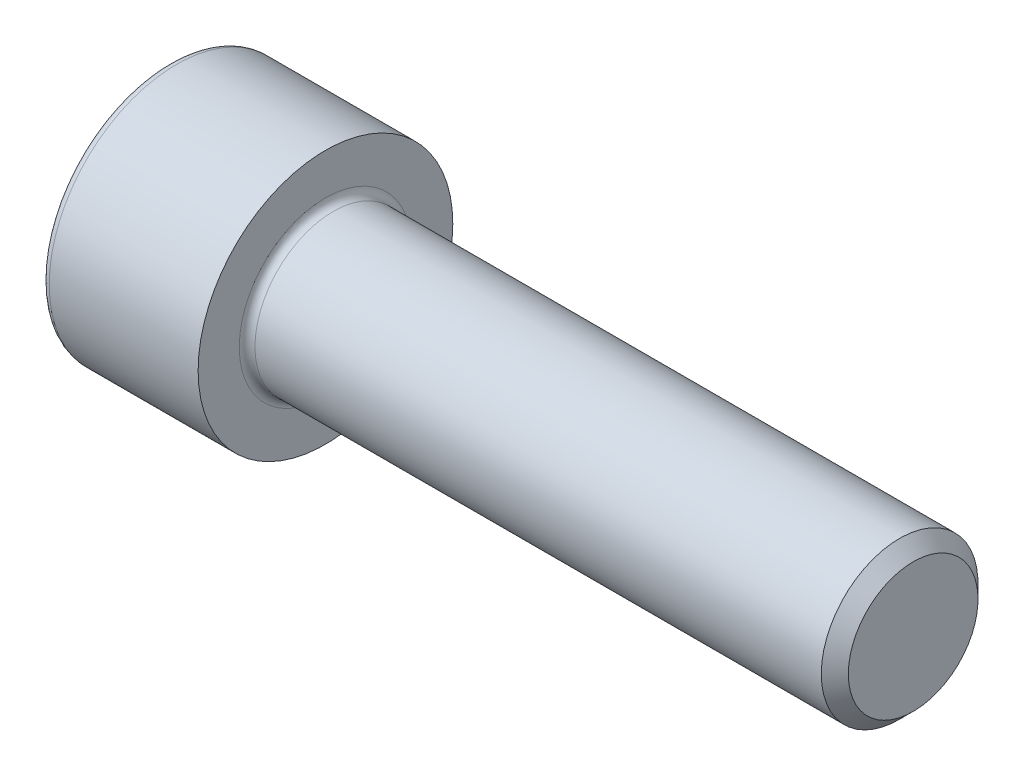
ISO-10303-21;
HEADER;
FILE_DESCRIPTION(('STEP AP214'),'2;1');
FILE_NAME('part.step','',(''),(''),'','','');
FILE_SCHEMA(('AUTOMOTIVE_DESIGN { 1 0 10303 214 1 1 1 1 }'));
ENDSEC;
DATA;
#1=APPLICATION_CONTEXT('core data for automotive mechanical design processes');
#2=APPLICATION_PROTOCOL_DEFINITION('international standard','automotive_design',2000,#1);
#3=PRODUCT_CONTEXT('',#1,'mechanical');
#4=PRODUCT('Part','Part','',(#3));
#5=PRODUCT_RELATED_PRODUCT_CATEGORY('part','',(#4));
#6=PRODUCT_DEFINITION_FORMATION('','',#4);
#7=PRODUCT_DEFINITION_CONTEXT('part definition',#1,'design');
#8=PRODUCT_DEFINITION('design','',#6,#7);
#9=PRODUCT_DEFINITION_SHAPE('','',#8);
#10=(LENGTH_UNIT() NAMED_UNIT(*) SI_UNIT(.MILLI.,.METRE.));
#11=(NAMED_UNIT(*) PLANE_ANGLE_UNIT() SI_UNIT($,.RADIAN.));
#12=(NAMED_UNIT(*) SI_UNIT($,.STERADIAN.) SOLID_ANGLE_UNIT());
#13=UNCERTAINTY_MEASURE_WITH_UNIT(LENGTH_MEASURE(1.E-05),#10,'distance_accuracy_value','');
#14=(GEOMETRIC_REPRESENTATION_CONTEXT(3) GLOBAL_UNCERTAINTY_ASSIGNED_CONTEXT((#13)) GLOBAL_UNIT_ASSIGNED_CONTEXT((#10,
#11,#12)) REPRESENTATION_CONTEXT('',''));
#15=CARTESIAN_POINT('',(0.,0.,0.));
#16=DIRECTION('',(0.,0.,1.));
#17=DIRECTION('',(1.,0.,0.));
#18=AXIS2_PLACEMENT_3D('',#15,#16,#17);
#19=CARTESIAN_POINT('',(4.00000000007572,-1.11022302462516E-13,1.66533453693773E-13));
#20=DIRECTION('',(-0.999999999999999,0.,0.));
#21=DIRECTION('',(0.,0.,0.999999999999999));
#22=AXIS2_PLACEMENT_3D('',#19,#20,#21);
#23=CONICAL_SURFACE('',#22,3.04749999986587,1.04719755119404);
#24=CARTESIAN_POINT('',(5.75947494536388,-1.11022302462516E-13,2.77555756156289E-13));
#25=VERTEX_POINT('',#24);
#26=VERTEX_LOOP('',#25);
#27=FACE_BOUND('',#26,.T.);
#28=CARTESIAN_POINT('',(4.00000000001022,-1.11022302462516E-13,2.22044604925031E-13));
#29=DIRECTION('',(-0.999999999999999,0.,0.));
#30=DIRECTION('',(0.,0.,0.999999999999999));
#31=AXIS2_PLACEMENT_3D('',#28,#29,#30);
#32=CIRCLE('',#31,3.04749999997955);
#33=CARTESIAN_POINT('',(4.00000000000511,-2.63921241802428,1.52374999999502));
#34=VERTEX_POINT('',#33);
#35=CARTESIAN_POINT('',(4.00000000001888,0.,3.04749999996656));
#36=VERTEX_POINT('',#35);
#37=EDGE_CURVE('E101',#34,#36,#32,.T.);
#38=ORIENTED_EDGE('',*,*,#37,.T.);
#39=CARTESIAN_POINT('',(4.00000000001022,-1.11022302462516E-13,2.22044604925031E-13));
#40=DIRECTION('',(-0.999999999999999,0.,0.));
#41=DIRECTION('',(0.,0.,0.999999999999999));
#42=AXIS2_PLACEMENT_3D('',#39,#40,#41);
#43=CIRCLE('',#42,3.04749999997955);
#44=CARTESIAN_POINT('',(4.00000000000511,2.63921241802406,1.52374999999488));
#45=VERTEX_POINT('',#44);
#46=EDGE_CURVE('E104',#36,#45,#43,.T.);
#47=ORIENTED_EDGE('',*,*,#46,.T.);
#48=CARTESIAN_POINT('',(4.00000000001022,-1.11022302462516E-13,2.22044604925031E-13));
#49=DIRECTION('',(-0.999999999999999,0.,0.));
#50=DIRECTION('',(0.,0.,0.999999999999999));
#51=AXIS2_PLACEMENT_3D('',#48,#49,#50);
#52=CIRCLE('',#51,3.04749999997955);
#53=CARTESIAN_POINT('',(4.000000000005,2.63921241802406,-1.52374999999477));
#54=VERTEX_POINT('',#53);
#55=EDGE_CURVE('E106',#45,#54,#52,.T.);
#56=ORIENTED_EDGE('',*,*,#55,.T.);
#57=CARTESIAN_POINT('',(4.00000000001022,-1.11022302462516E-13,2.22044604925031E-13));
#58=DIRECTION('',(-0.999999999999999,0.,0.));
#59=DIRECTION('',(0.,0.,0.999999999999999));
#60=AXIS2_PLACEMENT_3D('',#57,#58,#59);
#61=CIRCLE('',#60,3.04749999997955);
#62=CARTESIAN_POINT('',(4.00000000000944,-1.11022302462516E-13,-3.04749999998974));
#63=VERTEX_POINT('',#62);
#64=EDGE_CURVE('E120',#54,#63,#61,.T.);
#65=ORIENTED_EDGE('',*,*,#64,.T.);
#66=CARTESIAN_POINT('',(4.00000000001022,-1.11022302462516E-13,2.22044604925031E-13));
#67=DIRECTION('',(-0.999999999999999,0.,0.));
#68=DIRECTION('',(0.,0.,0.999999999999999));
#69=AXIS2_PLACEMENT_3D('',#66,#67,#68);
#70=CIRCLE('',#69,3.04749999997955);
#71=CARTESIAN_POINT('',(4.000000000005,-2.63921241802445,-1.52374999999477));
#72=VERTEX_POINT('',#71);
#73=EDGE_CURVE('E121',#63,#72,#70,.T.);
#74=ORIENTED_EDGE('',*,*,#73,.T.);
#75=CARTESIAN_POINT('',(4.00000000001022,-1.11022302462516E-13,2.22044604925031E-13));
#76=DIRECTION('',(-0.999999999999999,0.,0.));
#77=DIRECTION('',(0.,0.,0.999999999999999));
#78=AXIS2_PLACEMENT_3D('',#75,#76,#77);
#79=CIRCLE('',#78,3.04749999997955);
#80=EDGE_CURVE('E229',#72,#34,#79,.T.);
#81=ORIENTED_EDGE('',*,*,#80,.T.);
#82=EDGE_LOOP('',(#38,#47,#56,#65,#74,#81));
#83=FACE_BOUND('',#82,.T.);
#84=ADVANCED_FACE('F16',(#27,#83),#23,.F.);
#85=CARTESIAN_POINT('',(3.99999999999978,3.5189498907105,0.));
#86=DIRECTION('',(0.999999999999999,0.,0.));
#87=DIRECTION('',(0.,0.,-0.999999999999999));
#88=AXIS2_PLACEMENT_3D('',#85,#86,#87);
#89=PLANE('',#88);
#90=DIRECTION('',(0.,0.499999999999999,-0.866025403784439));
#91=VECTOR('',#90,1.);
#92=CARTESIAN_POINT('',(3.99999999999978,3.5189498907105,0.));
#93=LINE('',#92,#91);
#94=CARTESIAN_POINT('',(3.99999999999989,1.75947494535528,3.04750000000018));
#95=VERTEX_POINT('',#94);
#96=EDGE_CURVE('E124',#45,#95,#93,.F.);
#97=ORIENTED_EDGE('',*,*,#96,.F.);
#98=ORIENTED_EDGE('',*,*,#46,.F.);
#99=DIRECTION('',(0.,-1.,0.));
#100=VECTOR('',#99,1.);
#101=CARTESIAN_POINT('',(3.99999999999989,-1.75947494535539,3.04750000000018));
#102=LINE('',#101,#100);
#103=EDGE_CURVE('E126',#36,#95,#102,.F.);
#104=ORIENTED_EDGE('',*,*,#103,.T.);
#105=EDGE_LOOP('',(#97,#98,#104));
#106=FACE_BOUND('',#105,.T.);
#107=ADVANCED_FACE('F125',(#106),#89,.F.);
#108=CARTESIAN_POINT('',(3.99999999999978,3.5189498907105,0.));
#109=DIRECTION('',(0.999999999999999,0.,0.));
#110=DIRECTION('',(0.,0.,-0.999999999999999));
#111=AXIS2_PLACEMENT_3D('',#108,#109,#110);
#112=PLANE('',#111);
#113=DIRECTION('',(0.,-1.,0.));
#114=VECTOR('',#113,1.);
#115=CARTESIAN_POINT('',(3.99999999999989,-1.75947494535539,3.04750000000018));
#116=LINE('',#115,#114);
#117=CARTESIAN_POINT('',(3.99999999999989,-1.75947494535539,3.04750000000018));
#118=VERTEX_POINT('',#117);
#119=EDGE_CURVE('E129',#118,#36,#116,.F.);
#120=ORIENTED_EDGE('',*,*,#119,.T.);
#121=ORIENTED_EDGE('',*,*,#37,.F.);
#122=DIRECTION('',(0.,0.500000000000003,0.866025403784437));
#123=VECTOR('',#122,1.);
#124=CARTESIAN_POINT('',(3.99999999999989,-1.75947494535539,3.04750000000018));
#125=LINE('',#124,#123);
#126=EDGE_CURVE('E182',#118,#34,#125,.F.);
#127=ORIENTED_EDGE('',*,*,#126,.F.);
#128=EDGE_LOOP('',(#120,#121,#127));
#129=FACE_BOUND('',#128,.T.);
#130=ADVANCED_FACE('F488',(#129),#112,.F.);
#131=CARTESIAN_POINT('',(3.99999999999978,3.5189498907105,0.));
#132=DIRECTION('',(0.999999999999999,0.,0.));
#133=DIRECTION('',(0.,0.,-0.999999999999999));
#134=AXIS2_PLACEMENT_3D('',#131,#132,#133);
#135=PLANE('',#134);
#136=DIRECTION('',(0.,0.500000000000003,0.866025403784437));
#137=VECTOR('',#136,1.);
#138=CARTESIAN_POINT('',(3.99999999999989,-1.75947494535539,3.04750000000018));
#139=LINE('',#138,#137);
#140=CARTESIAN_POINT('',(4.,-3.51894989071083,0.));
#141=VERTEX_POINT('',#140);
#142=EDGE_CURVE('E178',#34,#141,#139,.F.);
#143=ORIENTED_EDGE('',*,*,#142,.F.);
#144=ORIENTED_EDGE('',*,*,#80,.F.);
#145=DIRECTION('',(0.,-0.499999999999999,0.866025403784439));
#146=VECTOR('',#145,1.);
#147=CARTESIAN_POINT('',(3.99999999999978,-3.51894989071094,0.));
#148=LINE('',#147,#146);
#149=EDGE_CURVE('E165',#141,#72,#148,.F.);
#150=ORIENTED_EDGE('',*,*,#149,.F.);
#151=EDGE_LOOP('',(#143,#144,#150));
#152=FACE_BOUND('',#151,.T.);
#153=ADVANCED_FACE('F480',(#152),#135,.F.);
#154=CARTESIAN_POINT('',(3.99999999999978,3.5189498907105,0.));
#155=DIRECTION('',(0.999999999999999,0.,0.));
#156=DIRECTION('',(0.,0.,-0.999999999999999));
#157=AXIS2_PLACEMENT_3D('',#154,#155,#156);
#158=PLANE('',#157);
#159=DIRECTION('',(0.,-0.499999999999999,0.866025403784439));
#160=VECTOR('',#159,1.);
#161=CARTESIAN_POINT('',(3.99999999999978,-3.51894989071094,0.));
#162=LINE('',#161,#160);
#163=CARTESIAN_POINT('',(3.99999999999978,-1.75947494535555,-3.04749999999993));
#164=VERTEX_POINT('',#163);
#165=EDGE_CURVE('E162',#72,#164,#162,.F.);
#166=ORIENTED_EDGE('',*,*,#165,.F.);
#167=ORIENTED_EDGE('',*,*,#73,.F.);
#168=DIRECTION('',(0.,1.,0.));
#169=VECTOR('',#168,1.);
#170=CARTESIAN_POINT('',(3.99999999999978,1.75947494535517,-3.04749999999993));
#171=LINE('',#170,#169);
#172=EDGE_CURVE('E156',#63,#164,#171,.F.);
#173=ORIENTED_EDGE('',*,*,#172,.T.);
#174=EDGE_LOOP('',(#166,#167,#173));
#175=FACE_BOUND('',#174,.T.);
#176=ADVANCED_FACE('F473',(#175),#158,.F.);
#177=CARTESIAN_POINT('',(3.99999999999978,3.5189498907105,0.));
#178=DIRECTION('',(0.999999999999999,0.,0.));
#179=DIRECTION('',(0.,0.,-0.999999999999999));
#180=AXIS2_PLACEMENT_3D('',#177,#178,#179);
#181=PLANE('',#180);
#182=DIRECTION('',(0.,0.500000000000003,0.866025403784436));
#183=VECTOR('',#182,1.);
#184=CARTESIAN_POINT('',(3.99999999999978,3.5189498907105,0.));
#185=LINE('',#184,#183);
#186=CARTESIAN_POINT('',(4.,3.51894989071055,0.));
#187=VERTEX_POINT('',#186);
#188=EDGE_CURVE('E118',#187,#54,#185,.F.);
#189=ORIENTED_EDGE('',*,*,#188,.T.);
#190=ORIENTED_EDGE('',*,*,#55,.F.);
#191=DIRECTION('',(0.,0.499999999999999,-0.866025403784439));
#192=VECTOR('',#191,1.);
#193=CARTESIAN_POINT('',(3.99999999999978,3.5189498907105,0.));
#194=LINE('',#193,#192);
#195=EDGE_CURVE('E115',#187,#45,#194,.F.);
#196=ORIENTED_EDGE('',*,*,#195,.F.);
#197=EDGE_LOOP('',(#189,#190,#196));
#198=FACE_BOUND('',#197,.T.);
#199=ADVANCED_FACE('F113',(#198),#181,.F.);
#200=CARTESIAN_POINT('',(3.99999999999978,3.5189498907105,0.));
#201=DIRECTION('',(0.999999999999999,0.,0.));
#202=DIRECTION('',(0.,0.,-0.999999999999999));
#203=AXIS2_PLACEMENT_3D('',#200,#201,#202);
#204=PLANE('',#203);
#205=DIRECTION('',(0.,1.,0.));
#206=VECTOR('',#205,1.);
#207=CARTESIAN_POINT('',(3.99999999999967,1.75947494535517,-3.04749999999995));
#208=LINE('',#207,#206);
#209=CARTESIAN_POINT('',(3.99999999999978,1.75947494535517,-3.04749999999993));
#210=VERTEX_POINT('',#209);
#211=EDGE_CURVE('E159',#210,#63,#208,.F.);
#212=ORIENTED_EDGE('',*,*,#211,.T.);
#213=ORIENTED_EDGE('',*,*,#64,.F.);
#214=DIRECTION('',(0.,0.500000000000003,0.866025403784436));
#215=VECTOR('',#214,1.);
#216=CARTESIAN_POINT('',(3.99999999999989,3.5189498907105,1.11022302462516E-13));
#217=LINE('',#216,#215);
#218=EDGE_CURVE('E316',#54,#210,#217,.F.);
#219=ORIENTED_EDGE('',*,*,#218,.T.);
#220=EDGE_LOOP('',(#212,#213,#219));
#221=FACE_BOUND('',#220,.T.);
#222=ADVANCED_FACE('F459',(#221),#204,.F.);
#223=CARTESIAN_POINT('',(3.99999999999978,3.5189498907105,0.));
#224=DIRECTION('',(0.,-0.866025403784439,-0.499999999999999));
#225=DIRECTION('',(0.,0.499999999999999,-0.866025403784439));
#226=AXIS2_PLACEMENT_3D('',#223,#224,#225);
#227=PLANE('',#226);
#228=ORIENTED_EDGE('',*,*,#96,.T.);
#229=DIRECTION('',(0.999999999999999,0.,0.));
#230=VECTOR('',#229,1.);
#231=CARTESIAN_POINT('',(3.99999999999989,1.75947494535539,3.04750000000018));
#232=LINE('',#231,#230);
#233=CARTESIAN_POINT('',(0.,1.75947494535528,3.04749999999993));
#234=VERTEX_POINT('',#233);
#235=EDGE_CURVE('E202',#95,#234,#232,.F.);
#236=ORIENTED_EDGE('',*,*,#235,.T.);
#237=DIRECTION('',(0.,-0.499999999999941,0.866025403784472));
#238=VECTOR('',#237,1.);
#239=CARTESIAN_POINT('',(0.,3.51894989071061,0.));
#240=LINE('',#239,#238);
#241=CARTESIAN_POINT('',(0.,3.5189498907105,0.));
#242=VERTEX_POINT('',#241);
#243=EDGE_CURVE('E142',#242,#234,#240,.T.);
#244=ORIENTED_EDGE('',*,*,#243,.F.);
#245=DIRECTION('',(0.999999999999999,0.,0.));
#246=VECTOR('',#245,1.);
#247=CARTESIAN_POINT('',(3.99999999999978,3.5189498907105,0.));
#248=LINE('',#247,#246);
#249=EDGE_CURVE('E133',#242,#187,#248,.T.);
#250=ORIENTED_EDGE('',*,*,#249,.T.);
#251=ORIENTED_EDGE('',*,*,#195,.T.);
#252=EDGE_LOOP('',(#228,#236,#244,#250,#251));
#253=FACE_BOUND('',#252,.T.);
#254=ADVANCED_FACE('F131',(#253),#227,.T.);
#255=CARTESIAN_POINT('',(3.99999999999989,-1.75947494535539,3.04750000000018));
#256=DIRECTION('',(0.,0.,0.999999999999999));
#257=DIRECTION('',(0.,-1.,0.));
#258=AXIS2_PLACEMENT_3D('',#255,#256,#257);
#259=PLANE('',#258);
#260=ORIENTED_EDGE('',*,*,#235,.F.);
#261=ORIENTED_EDGE('',*,*,#103,.F.);
#262=ORIENTED_EDGE('',*,*,#119,.F.);
#263=DIRECTION('',(0.999999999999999,0.,0.));
#264=VECTOR('',#263,1.);
#265=CARTESIAN_POINT('',(3.99999999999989,-1.75947494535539,3.04750000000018));
#266=LINE('',#265,#264);
#267=CARTESIAN_POINT('',(0.,-1.75947494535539,3.04749999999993));
#268=VERTEX_POINT('',#267);
#269=EDGE_CURVE('E197',#268,#118,#266,.T.);
#270=ORIENTED_EDGE('',*,*,#269,.F.);
#271=DIRECTION('',(0.,1.,0.));
#272=VECTOR('',#271,1.);
#273=CARTESIAN_POINT('',(0.,0.,3.04749999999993));
#274=LINE('',#273,#272);
#275=EDGE_CURVE('E145',#234,#268,#274,.F.);
#276=ORIENTED_EDGE('',*,*,#275,.F.);
#277=EDGE_LOOP('',(#260,#261,#262,#270,#276));
#278=FACE_BOUND('',#277,.T.);
#279=ADVANCED_FACE('F444',(#278),#259,.F.);
#280=CARTESIAN_POINT('',(3.99999999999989,-1.75947494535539,3.04750000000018));
#281=DIRECTION('',(0.,0.866025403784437,-0.500000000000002));
#282=DIRECTION('',(0.,0.500000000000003,0.866025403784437));
#283=AXIS2_PLACEMENT_3D('',#280,#281,#282);
#284=PLANE('',#283);
#285=ORIENTED_EDGE('',*,*,#142,.T.);
#286=DIRECTION('',(0.999999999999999,0.,0.));
#287=VECTOR('',#286,1.);
#288=CARTESIAN_POINT('',(3.99999999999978,-3.51894989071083,-1.66533453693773E-13));
#289=LINE('',#288,#287);
#290=CARTESIAN_POINT('',(-1.11022302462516E-13,-3.51894989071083,-1.11022302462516E-13));
#291=VERTEX_POINT('',#290);
#292=EDGE_CURVE('E173',#291,#141,#289,.T.);
#293=ORIENTED_EDGE('',*,*,#292,.F.);
#294=DIRECTION('',(0.,-0.499999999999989,-0.866025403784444));
#295=VECTOR('',#294,1.);
#296=CARTESIAN_POINT('',(0.,-1.75947494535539,3.04749999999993));
#297=LINE('',#296,#295);
#298=EDGE_CURVE('E188',#268,#291,#297,.T.);
#299=ORIENTED_EDGE('',*,*,#298,.F.);
#300=ORIENTED_EDGE('',*,*,#269,.T.);
#301=ORIENTED_EDGE('',*,*,#126,.T.);
#302=EDGE_LOOP('',(#285,#293,#299,#300,#301));
#303=FACE_BOUND('',#302,.T.);
#304=ADVANCED_FACE('F436',(#303),#284,.T.);
#305=CARTESIAN_POINT('',(3.99999999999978,-3.51894989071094,0.));
#306=DIRECTION('',(0.,0.866025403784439,0.499999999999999));
#307=DIRECTION('',(0.,-0.499999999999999,0.866025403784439));
#308=AXIS2_PLACEMENT_3D('',#305,#306,#307);
#309=PLANE('',#308);
#310=ORIENTED_EDGE('',*,*,#165,.T.);
#311=DIRECTION('',(0.999999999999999,0.,0.));
#312=VECTOR('',#311,1.);
#313=CARTESIAN_POINT('',(3.99999999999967,-1.7594749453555,-3.04749999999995));
#314=LINE('',#313,#312);
#315=CARTESIAN_POINT('',(-1.11022302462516E-13,-1.7594749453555,-3.0474999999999));
#316=VERTEX_POINT('',#315);
#317=EDGE_CURVE('E158',#164,#316,#314,.F.);
#318=ORIENTED_EDGE('',*,*,#317,.T.);
#319=DIRECTION('',(0.,0.500000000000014,-0.86602540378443));
#320=VECTOR('',#319,1.);
#321=CARTESIAN_POINT('',(-2.22044604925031E-13,-3.51894989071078,0.));
#322=LINE('',#321,#320);
#323=EDGE_CURVE('E185',#291,#316,#322,.T.);
#324=ORIENTED_EDGE('',*,*,#323,.F.);
#325=ORIENTED_EDGE('',*,*,#292,.T.);
#326=ORIENTED_EDGE('',*,*,#149,.T.);
#327=EDGE_LOOP('',(#310,#318,#324,#325,#326));
#328=FACE_BOUND('',#327,.T.);
#329=ADVANCED_FACE('F429',(#328),#309,.T.);
#330=CARTESIAN_POINT('',(3.99999999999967,1.75947494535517,-3.04749999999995));
#331=DIRECTION('',(0.,0.,-0.999999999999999));
#332=DIRECTION('',(0.,1.,0.));
#333=AXIS2_PLACEMENT_3D('',#330,#331,#332);
#334=PLANE('',#333);
#335=ORIENTED_EDGE('',*,*,#317,.F.);
#336=ORIENTED_EDGE('',*,*,#172,.F.);
#337=ORIENTED_EDGE('',*,*,#211,.F.);
#338=DIRECTION('',(0.999999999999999,0.,0.));
#339=VECTOR('',#338,1.);
#340=CARTESIAN_POINT('',(3.99999999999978,1.75947494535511,-3.04749999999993));
#341=LINE('',#340,#339);
#342=CARTESIAN_POINT('',(-1.11022302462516E-13,1.75947494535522,-3.04749999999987));
#343=VERTEX_POINT('',#342);
#344=EDGE_CURVE('E146',#210,#343,#341,.F.);
#345=ORIENTED_EDGE('',*,*,#344,.T.);
#346=DIRECTION('',(0.,1.,0.));
#347=VECTOR('',#346,1.);
#348=CARTESIAN_POINT('',(-1.11022302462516E-13,0.,-3.04749999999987));
#349=LINE('',#348,#347);
#350=EDGE_CURVE('E153',#316,#343,#349,.T.);
#351=ORIENTED_EDGE('',*,*,#350,.F.);
#352=EDGE_LOOP('',(#335,#336,#337,#345,#351));
#353=FACE_BOUND('',#352,.T.);
#354=ADVANCED_FACE('F334',(#353),#334,.F.);
#355=CARTESIAN_POINT('',(3.99999999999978,3.5189498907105,0.));
#356=DIRECTION('',(0.,0.866025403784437,-0.500000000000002));
#357=DIRECTION('',(0.,0.500000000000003,0.866025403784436));
#358=AXIS2_PLACEMENT_3D('',#355,#356,#357);
#359=PLANE('',#358);
#360=ORIENTED_EDGE('',*,*,#344,.F.);
#361=ORIENTED_EDGE('',*,*,#218,.F.);
#362=ORIENTED_EDGE('',*,*,#188,.F.);
#363=ORIENTED_EDGE('',*,*,#249,.F.);
#364=DIRECTION('',(0.,0.499999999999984,0.866025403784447));
#365=VECTOR('',#364,1.);
#366=CARTESIAN_POINT('',(-1.11022302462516E-13,1.75947494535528,-3.04750000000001));
#367=LINE('',#366,#365);
#368=EDGE_CURVE('E149',#343,#242,#367,.T.);
#369=ORIENTED_EDGE('',*,*,#368,.F.);
#370=EDGE_LOOP('',(#360,#361,#362,#363,#369));
#371=FACE_BOUND('',#370,.T.);
#372=ADVANCED_FACE('F339',(#371),#359,.F.);
#373=CARTESIAN_POINT('',(0.,0.,0.));
#374=DIRECTION('',(-0.999999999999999,0.,0.));
#375=DIRECTION('',(0.,0.,0.999999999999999));
#376=AXIS2_PLACEMENT_3D('',#373,#374,#375);
#377=PLANE('',#376);
#378=CARTESIAN_POINT('',(-1.55257751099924E-13,-2.22077942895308E-13,2.22155627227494E-13));
#379=DIRECTION('',(0.999999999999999,0.,0.));
#380=DIRECTION('',(0.,0.,-1.));
#381=AXIS2_PLACEMENT_3D('',#378,#379,#380);
#382=CIRCLE('',#381,6.10000000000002);
#383=CARTESIAN_POINT('',(-2.22044604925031E-13,-1.66533453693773E-13,-6.09999999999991));
#384=VERTEX_POINT('',#383);
#385=CARTESIAN_POINT('',(0.,-1.66533453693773E-13,6.10000000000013));
#386=VERTEX_POINT('',#385);
#387=EDGE_CURVE('E152',#384,#386,#382,.T.);
#388=ORIENTED_EDGE('',*,*,#387,.F.);
#389=CARTESIAN_POINT('',(-1.56125112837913E-13,-2.22077942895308E-13,2.22155627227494E-13));
#390=DIRECTION('',(0.999999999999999,0.,0.));
#391=DIRECTION('',(0.,0.,1.));
#392=AXIS2_PLACEMENT_3D('',#389,#390,#391);
#393=CIRCLE('',#392,6.09999999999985);
#394=EDGE_CURVE('E354',#386,#384,#393,.T.);
#395=ORIENTED_EDGE('',*,*,#394,.F.);
#396=EDGE_LOOP('',(#388,#395));
#397=FACE_BOUND('',#396,.T.);
#398=ORIENTED_EDGE('',*,*,#350,.T.);
#399=ORIENTED_EDGE('',*,*,#368,.T.);
#400=ORIENTED_EDGE('',*,*,#243,.T.);
#401=ORIENTED_EDGE('',*,*,#275,.T.);
#402=ORIENTED_EDGE('',*,*,#298,.T.);
#403=ORIENTED_EDGE('',*,*,#323,.T.);
#404=EDGE_LOOP('',(#398,#399,#400,#401,#402,#403));
#405=FACE_BOUND('',#404,.T.);
#406=ADVANCED_FACE('F298',(#397,#405),#377,.T.);
#407=CARTESIAN_POINT('',(0.399999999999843,-2.22044604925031E-13,2.22044604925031E-13));
#408=DIRECTION('',(-0.999999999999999,0.,0.));
#409=DIRECTION('',(0.,0.,1.));
#410=AXIS2_PLACEMENT_3D('',#407,#408,#409);
#411=TOROIDAL_SURFACE('',#410,6.09999999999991,0.4);
#412=CARTESIAN_POINT('',(0.399999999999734,-2.22044604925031E-13,0.));
#413=DIRECTION('',(-0.999999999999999,0.,0.));
#414=DIRECTION('',(0.,0.,0.999999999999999));
#415=AXIS2_PLACEMENT_3D('',#412,#413,#414);
#416=CIRCLE('',#415,6.5);
#417=CARTESIAN_POINT('',(0.399999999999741,-2.19365065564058E-13,6.49999999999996));
#418=VERTEX_POINT('',#417);
#419=EDGE_CURVE('E226',#418,#418,#416,.F.);
#420=ORIENTED_EDGE('',*,*,#419,.F.);
#421=EDGE_LOOP('',(#420));
#422=FACE_BOUND('',#421,.T.);
#423=ORIENTED_EDGE('',*,*,#394,.T.);
#424=ORIENTED_EDGE('',*,*,#387,.T.);
#425=EDGE_LOOP('',(#423,#424));
#426=FACE_BOUND('',#425,.T.);
#427=ADVANCED_FACE('F293',(#422,#426),#411,.T.);
#428=CARTESIAN_POINT('',(-31.7499999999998,-2.22044604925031E-13,0.));
#429=DIRECTION('',(-0.999999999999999,0.,0.));
#430=DIRECTION('',(0.,0.,0.999999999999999));
#431=AXIS2_PLACEMENT_3D('',#428,#429,#430);
#432=CYLINDRICAL_SURFACE('',#431,6.5);
#433=CARTESIAN_POINT('',(7.9999999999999,-2.22044604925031E-13,0.));
#434=DIRECTION('',(-0.999999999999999,0.,0.));
#435=DIRECTION('',(0.,0.,0.999999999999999));
#436=AXIS2_PLACEMENT_3D('',#433,#434,#435);
#437=CIRCLE('',#436,6.5);
#438=CARTESIAN_POINT('',(7.9999999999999,-2.18731644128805E-13,6.49999999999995));
#439=VERTEX_POINT('',#438);
#440=EDGE_CURVE('E224',#439,#439,#437,.F.);
#441=CARTESIAN_POINT('',(7.9999999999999,-2.18731644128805E-13,6.49999999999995));
#442=CARTESIAN_POINT('',(7.92083333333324,-2.18738242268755E-13,6.49999999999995));
#443=CARTESIAN_POINT('',(7.84166666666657,-2.18744840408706E-13,6.49999999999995));
#444=CARTESIAN_POINT('',(7.68333333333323,-2.18758036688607E-13,6.49999999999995));
#445=CARTESIAN_POINT('',(7.60416666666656,-2.18764634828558E-13,6.49999999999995));
#446=CARTESIAN_POINT('',(7.44583333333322,-2.18777831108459E-13,6.49999999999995));
#447=CARTESIAN_POINT('',(7.36666666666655,-2.18784429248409E-13,6.49999999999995));
#448=CARTESIAN_POINT('',(7.20833333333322,-2.1879762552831E-13,6.49999999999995));
#449=CARTESIAN_POINT('',(7.12916666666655,-2.18804223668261E-13,6.49999999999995));
#450=CARTESIAN_POINT('',(6.97083333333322,-2.18817419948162E-13,6.49999999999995));
#451=CARTESIAN_POINT('',(6.89166666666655,-2.18824018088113E-13,6.49999999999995));
#452=CARTESIAN_POINT('',(6.73333333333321,-2.18837214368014E-13,6.49999999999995));
#453=CARTESIAN_POINT('',(6.65416666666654,-2.18843812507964E-13,6.49999999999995));
#454=CARTESIAN_POINT('',(6.4958333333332,-2.18857008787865E-13,6.49999999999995));
#455=CARTESIAN_POINT('',(6.41666666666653,-2.18863606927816E-13,6.49999999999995));
#456=CARTESIAN_POINT('',(6.2583333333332,-2.18876803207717E-13,6.49999999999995));
#457=CARTESIAN_POINT('',(6.17916666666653,-2.18883401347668E-13,6.49999999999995));
#458=CARTESIAN_POINT('',(6.0208333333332,-2.18896597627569E-13,6.49999999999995));
#459=CARTESIAN_POINT('',(5.94166666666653,-2.18903195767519E-13,6.49999999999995));
#460=CARTESIAN_POINT('',(5.78333333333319,-2.1891639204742E-13,6.49999999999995));
#461=CARTESIAN_POINT('',(5.70416666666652,-2.18922990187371E-13,6.49999999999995));
#462=CARTESIAN_POINT('',(5.54583333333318,-2.18936186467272E-13,6.49999999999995));
#463=CARTESIAN_POINT('',(5.46666666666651,-2.18942784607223E-13,6.49999999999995));
#464=CARTESIAN_POINT('',(5.30833333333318,-2.18955980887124E-13,6.49999999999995));
#465=CARTESIAN_POINT('',(5.22916666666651,-2.18962579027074E-13,6.49999999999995));
#466=CARTESIAN_POINT('',(5.07083333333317,-2.18975775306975E-13,6.49999999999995));
#467=CARTESIAN_POINT('',(4.99166666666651,-2.18982373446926E-13,6.49999999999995));
#468=CARTESIAN_POINT('',(4.83333333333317,-2.18995569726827E-13,6.49999999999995));
#469=CARTESIAN_POINT('',(4.7541666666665,-2.19002167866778E-13,6.49999999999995));
#470=CARTESIAN_POINT('',(4.59583333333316,-2.19015364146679E-13,6.49999999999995));
#471=CARTESIAN_POINT('',(4.51666666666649,-2.19021962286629E-13,6.49999999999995));
#472=CARTESIAN_POINT('',(4.35833333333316,-2.1903515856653E-13,6.49999999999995));
#473=CARTESIAN_POINT('',(4.27916666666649,-2.19041756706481E-13,6.49999999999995));
#474=CARTESIAN_POINT('',(4.12083333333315,-2.19054952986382E-13,6.49999999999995));
#475=CARTESIAN_POINT('',(4.04166666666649,-2.19061551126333E-13,6.49999999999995));
#476=CARTESIAN_POINT('',(3.88333333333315,-2.19074747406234E-13,6.49999999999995));
#477=CARTESIAN_POINT('',(3.80416666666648,-2.19081345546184E-13,6.49999999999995));
#478=CARTESIAN_POINT('',(3.64583333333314,-2.19094541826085E-13,6.49999999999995));
#479=CARTESIAN_POINT('',(3.56666666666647,-2.19101139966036E-13,6.49999999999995));
#480=CARTESIAN_POINT('',(3.40833333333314,-2.19114336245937E-13,6.49999999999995));
#481=CARTESIAN_POINT('',(3.32916666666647,-2.19120934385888E-13,6.49999999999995));
#482=CARTESIAN_POINT('',(3.17083333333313,-2.19134130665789E-13,6.49999999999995));
#483=CARTESIAN_POINT('',(3.09166666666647,-2.19140728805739E-13,6.49999999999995));
#484=CARTESIAN_POINT('',(2.93333333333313,-2.1915392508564E-13,6.49999999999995));
#485=CARTESIAN_POINT('',(2.85416666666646,-2.19160523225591E-13,6.49999999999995));
#486=CARTESIAN_POINT('',(2.69583333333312,-2.19173719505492E-13,6.49999999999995));
#487=CARTESIAN_POINT('',(2.61666666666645,-2.19180317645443E-13,6.49999999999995));
#488=CARTESIAN_POINT('',(2.45833333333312,-2.19193513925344E-13,6.49999999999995));
#489=CARTESIAN_POINT('',(2.37916666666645,-2.19200112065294E-13,6.49999999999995));
#490=CARTESIAN_POINT('',(2.22083333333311,-2.19213308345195E-13,6.49999999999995));
#491=CARTESIAN_POINT('',(2.14166666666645,-2.19219906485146E-13,6.49999999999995));
#492=CARTESIAN_POINT('',(1.98333333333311,-2.19233102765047E-13,6.49999999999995));
#493=CARTESIAN_POINT('',(1.90416666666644,-2.19239700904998E-13,6.49999999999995));
#494=CARTESIAN_POINT('',(1.7458333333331,-2.19252897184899E-13,6.49999999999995));
#495=CARTESIAN_POINT('',(1.66666666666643,-2.19259495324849E-13,6.49999999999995));
#496=CARTESIAN_POINT('',(1.5083333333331,-2.1927269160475E-13,6.49999999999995));
#497=CARTESIAN_POINT('',(1.42916666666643,-2.19279289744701E-13,6.49999999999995));
#498=CARTESIAN_POINT('',(1.27083333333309,-2.19292486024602E-13,6.49999999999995));
#499=CARTESIAN_POINT('',(1.19166666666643,-2.19299084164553E-13,6.49999999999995));
#500=CARTESIAN_POINT('',(1.03333333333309,-2.19312280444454E-13,6.49999999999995));
#501=CARTESIAN_POINT('',(0.95416666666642,-2.19318878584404E-13,6.49999999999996));
#502=CARTESIAN_POINT('',(0.795833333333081,-2.19332074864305E-13,6.49999999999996));
#503=CARTESIAN_POINT('',(0.716666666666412,-2.19338673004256E-13,6.49999999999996));
#504=CARTESIAN_POINT('',(0.558333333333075,-2.19351869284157E-13,6.49999999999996));
#505=CARTESIAN_POINT('',(0.479166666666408,-2.19358467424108E-13,6.49999999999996));
#506=CARTESIAN_POINT('',(0.399999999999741,-2.19365065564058E-13,6.49999999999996));
#507=B_SPLINE_CURVE_WITH_KNOTS('',3,(#441,#442,#443,#444,#445,#446,#447,#448,#449,#450,#451,
#452,#453,#454,#455,#456,#457,#458,#459,#460,#461,#462,#463,#464,#465,#466,#467,#468,#469,#470,
#471,#472,#473,#474,#475,#476,#477,#478,#479,#480,#481,#482,#483,#484,#485,#486,#487,#488,#489,
#490,#491,#492,#493,#494,#495,#496,#497,#498,#499,#500,#501,#502,#503,#504,#505,#506),
.UNSPECIFIED.,.F.,.F.,(4,2,2,2,2,2,2,2,2,2,2,2,2,2,2,2,2,2,2,2,2,2,2,2,2,2,2,2,2,2,2,2,4),(0.,
0.237500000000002,0.47500000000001,0.712500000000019,0.95000000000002,1.18750000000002,
1.42500000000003,1.66250000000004,1.90000000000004,2.13750000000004,2.37500000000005,
2.61250000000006,2.85000000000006,3.08750000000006,3.32500000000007,3.56250000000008,
3.80000000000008,4.03750000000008,4.27500000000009,4.5125000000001,4.7500000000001,
4.9875000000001,5.22500000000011,5.46250000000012,5.70000000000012,5.93750000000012,
6.17500000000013,6.41250000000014,6.65000000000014,6.88750000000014,7.12500000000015,
7.36250000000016,7.60000000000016),.UNSPECIFIED.);
#508=EDGE_CURVE('BSEAM297',#439,#418,#507,.T.);
#509=ORIENTED_EDGE('',*,*,#440,.F.);
#510=ORIENTED_EDGE('',*,*,#419,.T.);
#511=ORIENTED_EDGE('',*,*,#508,.T.);
#512=ORIENTED_EDGE('',*,*,#508,.F.);
#513=EDGE_LOOP('',(#509,#511,#510,#512));
#514=FACE_BOUND('',#513,.T.);
#515=ADVANCED_FACE('F297',(#514),#432,.T.);
#516=CARTESIAN_POINT('',(37.9999999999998,3.30949999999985,0.));
#517=DIRECTION('',(0.999999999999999,0.,0.));
#518=DIRECTION('',(0.,0.,-0.999999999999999));
#519=AXIS2_PLACEMENT_3D('',#516,#517,#518);
#520=PLANE('',#519);
#521=CARTESIAN_POINT('',(38.0000000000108,0.,0.));
#522=DIRECTION('',(-0.999999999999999,0.,0.));
#523=DIRECTION('',(0.,0.,0.999999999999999));
#524=AXIS2_PLACEMENT_3D('',#521,#522,#523);
#525=CIRCLE('',#524,3.30950000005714);
#526=CARTESIAN_POINT('',(38.0000000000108,0.,3.30950000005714));
#527=VERTEX_POINT('',#526);
#528=EDGE_CURVE('E220',#527,#527,#525,.T.);
#529=ORIENTED_EDGE('',*,*,#528,.F.);
#530=EDGE_LOOP('',(#529));
#531=FACE_BOUND('',#530,.T.);
#532=ADVANCED_FACE('F270',(#531),#520,.T.);
#533=CARTESIAN_POINT('',(7.9999999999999,6.50000000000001,0.));
#534=DIRECTION('',(0.999999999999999,0.,0.));
#535=DIRECTION('',(0.,0.,-0.999999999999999));
#536=AXIS2_PLACEMENT_3D('',#533,#534,#535);
#537=PLANE('',#536);
#538=ORIENTED_EDGE('',*,*,#440,.T.);
#539=EDGE_LOOP('',(#538));
#540=FACE_BOUND('',#539,.T.);
#541=CARTESIAN_POINT('',(8.00000000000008,-2.22077942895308E-13,1.38888900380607E-13));
#542=DIRECTION('',(0.999999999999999,0.,0.));
#543=DIRECTION('',(0.,0.,1.));
#544=AXIS2_PLACEMENT_3D('',#541,#542,#543);
#545=CIRCLE('',#544,4.39999999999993);
#546=CARTESIAN_POINT('',(7.9999999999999,-2.22044604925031E-13,-4.39999999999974));
#547=VERTEX_POINT('',#546);
#548=CARTESIAN_POINT('',(8.00000000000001,-2.22044604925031E-13,4.40000000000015));
#549=VERTEX_POINT('',#548);
#550=EDGE_CURVE('E223',#547,#549,#545,.F.);
#551=ORIENTED_EDGE('',*,*,#550,.T.);
#552=CARTESIAN_POINT('',(8.00000000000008,-2.22077942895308E-13,1.38888900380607E-13));
#553=DIRECTION('',(0.999999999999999,0.,0.));
#554=DIRECTION('',(0.,0.,-1.));
#555=AXIS2_PLACEMENT_3D('',#552,#553,#554);
#556=CIRCLE('',#555,4.39999999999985);
#557=EDGE_CURVE('E35',#549,#547,#556,.F.);
#558=ORIENTED_EDGE('',*,*,#557,.T.);
#559=EDGE_LOOP('',(#551,#558));
#560=FACE_BOUND('',#559,.T.);
#561=ADVANCED_FACE('F261',(#540,#560),#537,.T.);
#562=CARTESIAN_POINT('',(37.309500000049,0.,-1.11022302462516E-13));
#563=DIRECTION('',(-0.999999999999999,0.,0.));
#564=DIRECTION('',(0.,0.,0.999999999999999));
#565=AXIS2_PLACEMENT_3D('',#562,#563,#564);
#566=CONICAL_SURFACE('',#565,4.0000000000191,0.785398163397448);
#567=CARTESIAN_POINT('',(37.3094999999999,-2.77555756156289E-13,-1.11022302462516E-13));
#568=DIRECTION('',(-0.999999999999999,0.,0.));
#569=DIRECTION('',(0.,0.,0.999999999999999));
#570=AXIS2_PLACEMENT_3D('',#567,#568,#569);
#571=CIRCLE('',#570,3.99999999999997);
#572=CARTESIAN_POINT('',(37.3094999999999,0.,4.00000000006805));
#573=VERTEX_POINT('',#572);
#574=EDGE_CURVE('E27',#573,#573,#571,.T.);
#575=CARTESIAN_POINT('',(37.3094999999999,0.,4.00000000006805));
#576=CARTESIAN_POINT('',(37.3166927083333,0.,3.99280729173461));
#577=CARTESIAN_POINT('',(37.3238854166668,0.,3.98561458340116));
#578=CARTESIAN_POINT('',(37.3382708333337,0.,3.97122916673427));
#579=CARTESIAN_POINT('',(37.3454635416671,0.,3.96403645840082));
#580=CARTESIAN_POINT('',(37.359848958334,0.,3.94965104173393));
#581=CARTESIAN_POINT('',(37.3670416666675,0.,3.94245833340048));
#582=CARTESIAN_POINT('',(37.3814270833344,0.,3.92807291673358));
#583=CARTESIAN_POINT('',(37.3886197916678,0.,3.92088020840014));
#584=CARTESIAN_POINT('',(37.4030052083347,0.,3.90649479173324));
#585=CARTESIAN_POINT('',(37.4101979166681,0.,3.89930208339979));
#586=CARTESIAN_POINT('',(37.424583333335,0.,3.8849166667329));
#587=CARTESIAN_POINT('',(37.4317760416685,0.,3.87772395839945));
#588=CARTESIAN_POINT('',(37.4461614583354,0.,3.86333854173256));
#589=CARTESIAN_POINT('',(37.4533541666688,0.,3.85614583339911));
#590=CARTESIAN_POINT('',(37.4677395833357,0.,3.84176041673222));
#591=CARTESIAN_POINT('',(37.4749322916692,0.,3.83456770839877));
#592=CARTESIAN_POINT('',(37.4893177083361,0.,3.82018229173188));
#593=CARTESIAN_POINT('',(37.4965104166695,0.,3.81298958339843));
#594=CARTESIAN_POINT('',(37.5108958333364,0.,3.79860416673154));
#595=CARTESIAN_POINT('',(37.5180885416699,0.,3.79141145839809));
#596=CARTESIAN_POINT('',(37.5324739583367,0.,3.7770260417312));
#597=CARTESIAN_POINT('',(37.5396666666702,0.,3.76983333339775));
#598=CARTESIAN_POINT('',(37.5540520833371,0.,3.75544791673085));
#599=CARTESIAN_POINT('',(37.5612447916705,0.,3.74825520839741));
#600=CARTESIAN_POINT('',(37.5756302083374,0.,3.73386979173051));
#601=CARTESIAN_POINT('',(37.5828229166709,0.,3.72667708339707));
#602=CARTESIAN_POINT('',(37.5972083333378,0.,3.71229166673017));
#603=CARTESIAN_POINT('',(37.6044010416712,0.,3.70509895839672));
#604=CARTESIAN_POINT('',(37.6187864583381,0.,3.69071354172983));
#605=CARTESIAN_POINT('',(37.6259791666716,0.,3.68352083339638));
#606=CARTESIAN_POINT('',(37.6403645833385,0.,3.66913541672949));
#607=CARTESIAN_POINT('',(37.6475572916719,0.,3.66194270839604));
#608=CARTESIAN_POINT('',(37.6619427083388,0.,3.64755729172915));
#609=CARTESIAN_POINT('',(37.6691354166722,0.,3.6403645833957));
#610=CARTESIAN_POINT('',(37.6835208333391,0.,3.62597916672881));
#611=CARTESIAN_POINT('',(37.6907135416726,0.,3.61878645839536));
#612=CARTESIAN_POINT('',(37.7050989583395,0.,3.60440104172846));
#613=CARTESIAN_POINT('',(37.7122916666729,0.,3.59720833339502));
#614=CARTESIAN_POINT('',(37.7266770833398,0.,3.58282291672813));
#615=CARTESIAN_POINT('',(37.7338697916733,0.,3.57563020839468));
#616=CARTESIAN_POINT('',(37.7482552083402,0.,3.56124479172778));
#617=CARTESIAN_POINT('',(37.7554479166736,0.,3.55405208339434));
#618=CARTESIAN_POINT('',(37.7698333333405,0.,3.53966666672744));
#619=CARTESIAN_POINT('',(37.7770260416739,0.,3.532473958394));
#620=CARTESIAN_POINT('',(37.7914114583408,0.,3.5180885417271));
#621=CARTESIAN_POINT('',(37.7986041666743,0.,3.51089583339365));
#622=CARTESIAN_POINT('',(37.8129895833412,0.,3.49651041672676));
#623=CARTESIAN_POINT('',(37.8201822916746,0.,3.48931770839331));
#624=CARTESIAN_POINT('',(37.8345677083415,0.,3.47493229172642));
#625=CARTESIAN_POINT('',(37.841760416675,0.,3.46773958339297));
#626=CARTESIAN_POINT('',(37.8561458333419,0.,3.45335416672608));
#627=CARTESIAN_POINT('',(37.8633385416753,0.,3.44616145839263));
#628=CARTESIAN_POINT('',(37.8777239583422,0.,3.43177604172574));
#629=CARTESIAN_POINT('',(37.8849166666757,0.,3.42458333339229));
#630=CARTESIAN_POINT('',(37.8993020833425,0.,3.41019791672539));
#631=CARTESIAN_POINT('',(37.906494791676,0.,3.40300520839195));
#632=CARTESIAN_POINT('',(37.9208802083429,0.,3.38861979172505));
#633=CARTESIAN_POINT('',(37.9280729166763,0.,3.38142708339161));
#634=CARTESIAN_POINT('',(37.9424583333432,0.,3.36704166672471));
#635=CARTESIAN_POINT('',(37.9496510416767,0.,3.35984895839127));
#636=CARTESIAN_POINT('',(37.9640364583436,0.,3.34546354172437));
#637=CARTESIAN_POINT('',(37.971229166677,0.,3.33827083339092));
#638=CARTESIAN_POINT('',(37.9856145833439,0.,3.32388541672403));
#639=CARTESIAN_POINT('',(37.9928072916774,0.,3.31669270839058));
#640=CARTESIAN_POINT('',(38.0000000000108,0.,3.30950000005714));
#641=B_SPLINE_CURVE_WITH_KNOTS('',3,(#575,#576,#577,#578,#579,#580,#581,#582,#583,#584,#585,
#586,#587,#588,#589,#590,#591,#592,#593,#594,#595,#596,#597,#598,#599,#600,#601,#602,#603,#604,
#605,#606,#607,#608,#609,#610,#611,#612,#613,#614,#615,#616,#617,#618,#619,#620,#621,#622,#623,
#624,#625,#626,#627,#628,#629,#630,#631,#632,#633,#634,#635,#636,#637,#638,#639,#640),
.UNSPECIFIED.,.F.,.F.,(4,2,2,2,2,2,2,2,2,2,2,2,2,2,2,2,2,2,2,2,2,2,2,2,2,2,2,2,2,2,2,2,4),(0.,
0.0305160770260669,0.0610321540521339,0.0915482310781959,0.122064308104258,0.152580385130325,
0.183096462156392,0.213612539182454,0.244128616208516,0.274644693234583,0.30516077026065,
0.335676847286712,0.366192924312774,0.396709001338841,0.427225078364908,0.45774115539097,
0.488257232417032,0.518773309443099,0.549289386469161,0.579805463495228,0.610321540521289,
0.640837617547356,0.671353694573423,0.701869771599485,0.732385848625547,0.762901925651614,
0.793418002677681,0.823934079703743,0.854450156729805,0.884966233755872,0.915482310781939,
0.945998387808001,0.976514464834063),.UNSPECIFIED.);
#642=EDGE_CURVE('BSEAM249',#573,#527,#641,.T.);
#643=ORIENTED_EDGE('',*,*,#574,.F.);
#644=ORIENTED_EDGE('',*,*,#528,.T.);
#645=ORIENTED_EDGE('',*,*,#642,.T.);
#646=ORIENTED_EDGE('',*,*,#642,.F.);
#647=EDGE_LOOP('',(#643,#645,#644,#646));
#648=FACE_BOUND('',#647,.T.);
#649=ADVANCED_FACE('F249',(#648),#566,.T.);
#650=CARTESIAN_POINT('',(8.40000000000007,-2.22044604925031E-13,1.38777878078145E-13));
#651=DIRECTION('',(0.999999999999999,0.,0.));
#652=DIRECTION('',(0.,0.,-1.));
#653=AXIS2_PLACEMENT_3D('',#650,#651,#652);
#654=TOROIDAL_SURFACE('',#653,4.39999999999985,0.4);
#655=CARTESIAN_POINT('',(8.39999999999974,-2.22044604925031E-13,1.66533453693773E-13));
#656=DIRECTION('',(-0.999999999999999,0.,0.));
#657=DIRECTION('',(0.,0.,0.999999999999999));
#658=AXIS2_PLACEMENT_3D('',#655,#656,#657);
#659=CIRCLE('',#658,3.99999999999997);
#660=CARTESIAN_POINT('',(8.39999999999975,-2.18698306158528E-13,3.99999999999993));
#661=VERTEX_POINT('',#660);
#662=EDGE_CURVE('E11',#661,#661,#659,.F.);
#663=ORIENTED_EDGE('',*,*,#662,.F.);
#664=EDGE_LOOP('',(#663));
#665=FACE_BOUND('',#664,.T.);
#666=ORIENTED_EDGE('',*,*,#550,.F.);
#667=ORIENTED_EDGE('',*,*,#557,.F.);
#668=EDGE_LOOP('',(#666,#667));
#669=FACE_BOUND('',#668,.T.);
#670=ADVANCED_FACE('F237',(#665,#669),#654,.F.);
#671=CARTESIAN_POINT('',(-31.7499999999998,-2.22044604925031E-13,0.));
#672=DIRECTION('',(-0.999999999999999,0.,0.));
#673=DIRECTION('',(0.,0.,0.999999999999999));
#674=AXIS2_PLACEMENT_3D('',#671,#672,#673);
#675=CYLINDRICAL_SURFACE('',#674,3.99999999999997);
#676=CARTESIAN_POINT('',(8.39999999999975,-2.18698306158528E-13,3.99999999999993));
#677=CARTESIAN_POINT('',(8.70114062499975,-2.18673207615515E-13,3.99999999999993));
#678=CARTESIAN_POINT('',(9.00228124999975,-2.18648109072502E-13,3.99999999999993));
#679=CARTESIAN_POINT('',(9.60456249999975,-2.18597911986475E-13,3.99999999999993));
#680=CARTESIAN_POINT('',(9.90570312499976,-2.18572813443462E-13,3.99999999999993));
#681=CARTESIAN_POINT('',(10.5079843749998,-2.18522616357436E-13,3.99999999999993));
#682=CARTESIAN_POINT('',(10.8091249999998,-2.18497517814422E-13,3.99999999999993));
#683=CARTESIAN_POINT('',(11.4114062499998,-2.18447320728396E-13,3.99999999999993));
#684=CARTESIAN_POINT('',(11.7125468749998,-2.18422222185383E-13,3.99999999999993));
#685=CARTESIAN_POINT('',(12.3148281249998,-2.18372025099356E-13,3.99999999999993));
#686=CARTESIAN_POINT('',(12.6159687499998,-2.18346926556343E-13,3.99999999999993));
#687=CARTESIAN_POINT('',(13.2182499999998,-2.18296729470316E-13,3.99999999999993));
#688=CARTESIAN_POINT('',(13.5193906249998,-2.18271630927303E-13,3.99999999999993));
#689=CARTESIAN_POINT('',(14.1216718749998,-2.18221433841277E-13,3.99999999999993));
#690=CARTESIAN_POINT('',(14.4228124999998,-2.18196335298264E-13,3.99999999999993));
#691=CARTESIAN_POINT('',(15.0250937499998,-2.18146138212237E-13,3.99999999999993));
#692=CARTESIAN_POINT('',(15.3262343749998,-2.18121039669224E-13,3.99999999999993));
#693=CARTESIAN_POINT('',(15.9285156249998,-2.18070842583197E-13,3.99999999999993));
#694=CARTESIAN_POINT('',(16.2296562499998,-2.18045744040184E-13,3.99999999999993));
#695=CARTESIAN_POINT('',(16.8319374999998,-2.17995546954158E-13,3.99999999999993));
#696=CARTESIAN_POINT('',(17.1330781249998,-2.17970448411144E-13,3.99999999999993));
#697=CARTESIAN_POINT('',(17.7353593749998,-2.17920251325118E-13,3.99999999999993));
#698=CARTESIAN_POINT('',(18.0364999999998,-2.17895152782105E-13,3.99999999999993));
#699=CARTESIAN_POINT('',(18.6387812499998,-2.17844955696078E-13,3.99999999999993));
#700=CARTESIAN_POINT('',(18.9399218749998,-2.17819857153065E-13,3.99999999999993));
#701=CARTESIAN_POINT('',(19.5422031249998,-2.17769660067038E-13,3.99999999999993));
#702=CARTESIAN_POINT('',(19.8433437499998,-2.17744561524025E-13,3.99999999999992));
#703=CARTESIAN_POINT('',(20.4456249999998,-2.17694364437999E-13,3.99999999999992));
#704=CARTESIAN_POINT('',(20.7467656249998,-2.17669265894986E-13,3.99999999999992));
#705=CARTESIAN_POINT('',(21.3490468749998,-2.17619068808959E-13,3.99999999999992));
#706=CARTESIAN_POINT('',(21.6501874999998,-2.17593970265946E-13,3.99999999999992));
#707=CARTESIAN_POINT('',(22.2524687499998,-2.17543773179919E-13,3.99999999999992));
#708=CARTESIAN_POINT('',(22.5536093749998,-2.17518674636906E-13,3.99999999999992));
#709=CARTESIAN_POINT('',(23.1558906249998,-2.1746847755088E-13,3.99999999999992));
#710=CARTESIAN_POINT('',(23.4570312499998,-2.17443379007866E-13,3.99999999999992));
#711=CARTESIAN_POINT('',(24.0593124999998,-2.1739318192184E-13,3.99999999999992));
#712=CARTESIAN_POINT('',(24.3604531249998,-2.17368083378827E-13,3.99999999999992));
#713=CARTESIAN_POINT('',(24.9627343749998,-2.173178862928E-13,3.99999999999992));
#714=CARTESIAN_POINT('',(25.2638749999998,-2.17292787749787E-13,3.99999999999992));
#715=CARTESIAN_POINT('',(25.8661562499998,-2.17242590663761E-13,3.99999999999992));
#716=CARTESIAN_POINT('',(26.1672968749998,-2.17217492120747E-13,3.99999999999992));
#717=CARTESIAN_POINT('',(26.7695781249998,-2.17167295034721E-13,3.99999999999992));
#718=CARTESIAN_POINT('',(27.0707187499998,-2.17142196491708E-13,3.99999999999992));
#719=CARTESIAN_POINT('',(27.6729999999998,-2.17091999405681E-13,3.99999999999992));
#720=CARTESIAN_POINT('',(27.9741406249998,-2.17066900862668E-13,3.99999999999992));
#721=CARTESIAN_POINT('',(28.5764218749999,-2.17016703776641E-13,3.99999999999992));
#722=CARTESIAN_POINT('',(28.8775624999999,-2.16991605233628E-13,3.99999999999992));
#723=CARTESIAN_POINT('',(29.4798437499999,-2.16941408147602E-13,3.99999999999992));
#724=CARTESIAN_POINT('',(29.7809843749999,-2.16916309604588E-13,3.99999999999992));
#725=CARTESIAN_POINT('',(30.3832656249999,-2.16866112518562E-13,3.99999999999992));
#726=CARTESIAN_POINT('',(30.6844062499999,-2.16841013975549E-13,3.99999999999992));
#727=CARTESIAN_POINT('',(31.2866874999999,-2.16790816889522E-13,3.99999999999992));
#728=CARTESIAN_POINT('',(31.5878281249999,-2.16765718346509E-13,3.99999999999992));
#729=CARTESIAN_POINT('',(32.1901093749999,-2.16715521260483E-13,3.99999999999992));
#730=CARTESIAN_POINT('',(32.4912499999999,-2.16690422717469E-13,3.99999999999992));
#731=CARTESIAN_POINT('',(33.0935312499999,-2.16640225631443E-13,3.99999999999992));
#732=CARTESIAN_POINT('',(33.3946718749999,-2.1661512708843E-13,3.99999999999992));
#733=CARTESIAN_POINT('',(33.9969531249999,-2.16564930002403E-13,3.99999999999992));
#734=CARTESIAN_POINT('',(34.2980937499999,-2.1653983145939E-13,3.99999999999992));
#735=CARTESIAN_POINT('',(34.9003749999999,-2.16489634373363E-13,3.99999999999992));
#736=CARTESIAN_POINT('',(35.2015156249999,-2.1646453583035E-13,3.99999999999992));
#737=CARTESIAN_POINT('',(35.8037968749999,-2.16414338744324E-13,3.99999999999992));
#738=CARTESIAN_POINT('',(36.1049374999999,-2.1638924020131E-13,3.99999999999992));
#739=CARTESIAN_POINT('',(36.7072187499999,-2.16339043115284E-13,3.99999999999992));
#740=CARTESIAN_POINT('',(37.0083593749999,-2.16313944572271E-13,3.99999999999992));
#741=CARTESIAN_POINT('',(37.3094999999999,-2.16288846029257E-13,3.99999999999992));
#742=B_SPLINE_CURVE_WITH_KNOTS('',3,(#676,#677,#678,#679,#680,#681,#682,#683,#684,#685,#686,
#687,#688,#689,#690,#691,#692,#693,#694,#695,#696,#697,#698,#699,#700,#701,#702,#703,#704,#705,
#706,#707,#708,#709,#710,#711,#712,#713,#714,#715,#716,#717,#718,#719,#720,#721,#722,#723,#724,
#725,#726,#727,#728,#729,#730,#731,#732,#733,#734,#735,#736,#737,#738,#739,#740,#741),
.UNSPECIFIED.,.F.,.F.,(4,2,2,2,2,2,2,2,2,2,2,2,2,2,2,2,2,2,2,2,2,2,2,2,2,2,2,2,2,2,2,2,4),(0.,
0.903421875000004,1.80684375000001,2.71026562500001,3.61368750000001,4.51710937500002,
5.42053125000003,6.32395312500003,7.22737500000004,8.13079687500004,9.03421875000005,
9.93764062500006,10.8410625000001,11.7444843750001,12.6479062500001,13.5513281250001,
14.4547500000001,15.3581718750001,16.2615937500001,17.1650156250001,18.0684375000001,
18.9718593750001,19.8752812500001,20.7787031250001,21.6821250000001,22.5855468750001,
23.4889687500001,24.3923906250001,25.2958125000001,26.1992343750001,27.1026562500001,
28.0060781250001,28.9095000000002),.UNSPECIFIED.);
#743=EDGE_CURVE('BSEAM248',#661,#573,#742,.T.);
#744=ORIENTED_EDGE('',*,*,#662,.T.);
#745=ORIENTED_EDGE('',*,*,#574,.T.);
#746=ORIENTED_EDGE('',*,*,#743,.T.);
#747=ORIENTED_EDGE('',*,*,#743,.F.);
#748=EDGE_LOOP('',(#744,#746,#745,#747));
#749=FACE_BOUND('',#748,.T.);
#750=ADVANCED_FACE('F248',(#749),#675,.T.);
#751=CLOSED_SHELL('',(#84,#107,#130,#153,#176,#199,#222,#254,#279,#304,#329,#354,#372,#406,#427,
#515,#532,#561,#649,#670,#750));
#752=MANIFOLD_SOLID_BREP('B1',#751);
#753=ADVANCED_BREP_SHAPE_REPRESENTATION('',(#18,#752),#14);
#754=SHAPE_DEFINITION_REPRESENTATION(#9,#753);
ENDSEC;
END-ISO-10303-21;
